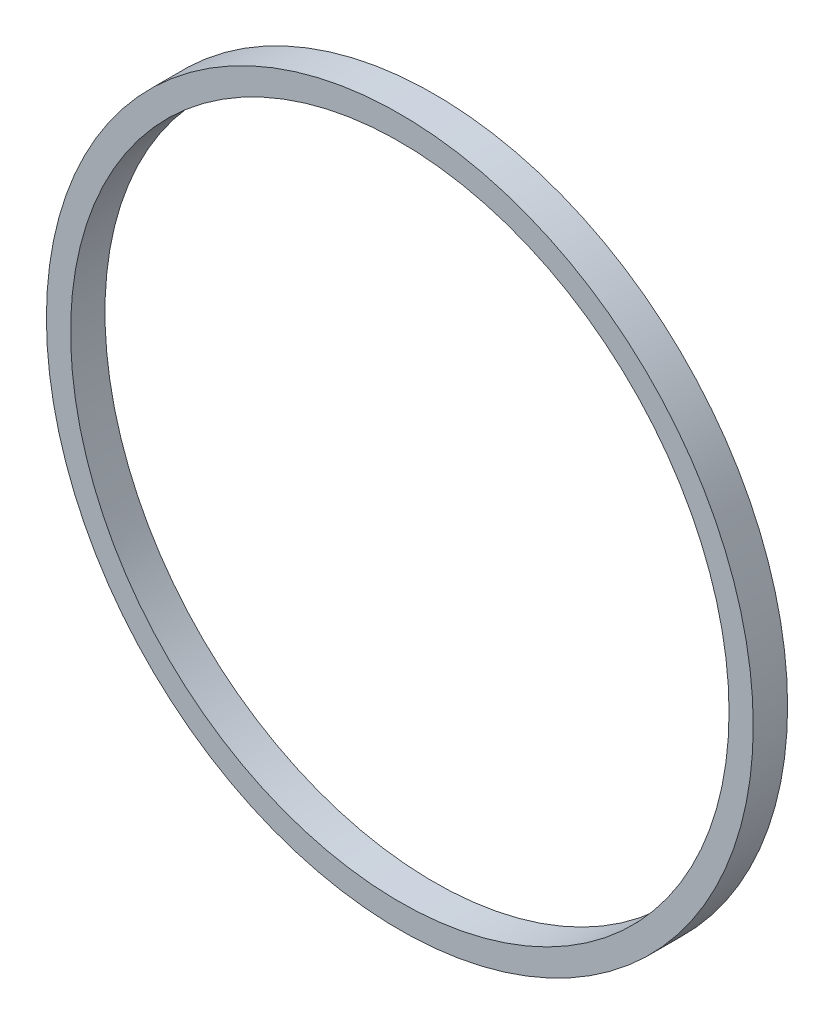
ISO-10303-21;
HEADER;
FILE_DESCRIPTION(('STEP AP214'),'2;1');
FILE_NAME('part.step','',(''),(''),'','','');
FILE_SCHEMA(('AUTOMOTIVE_DESIGN { 1 0 10303 214 1 1 1 1 }'));
ENDSEC;
DATA;
#1=APPLICATION_CONTEXT('core data for automotive mechanical design processes');
#2=APPLICATION_PROTOCOL_DEFINITION('international standard','automotive_design',2000,#1);
#3=PRODUCT_CONTEXT('',#1,'mechanical');
#4=PRODUCT('Part','Part','',(#3));
#5=PRODUCT_RELATED_PRODUCT_CATEGORY('part','',(#4));
#6=PRODUCT_DEFINITION_FORMATION('','',#4);
#7=PRODUCT_DEFINITION_CONTEXT('part definition',#1,'design');
#8=PRODUCT_DEFINITION('design','',#6,#7);
#9=PRODUCT_DEFINITION_SHAPE('','',#8);
#10=(LENGTH_UNIT() NAMED_UNIT(*) SI_UNIT(.MILLI.,.METRE.));
#11=(NAMED_UNIT(*) PLANE_ANGLE_UNIT() SI_UNIT($,.RADIAN.));
#12=(NAMED_UNIT(*) SI_UNIT($,.STERADIAN.) SOLID_ANGLE_UNIT());
#13=UNCERTAINTY_MEASURE_WITH_UNIT(LENGTH_MEASURE(1.E-05),#10,'distance_accuracy_value','');
#14=(GEOMETRIC_REPRESENTATION_CONTEXT(3) GLOBAL_UNCERTAINTY_ASSIGNED_CONTEXT((#13)) GLOBAL_UNIT_ASSIGNED_CONTEXT((#10,
#11,#12)) REPRESENTATION_CONTEXT('',''));
#15=CARTESIAN_POINT('',(0.,0.,0.));
#16=DIRECTION('',(0.,0.,1.));
#17=DIRECTION('',(1.,0.,0.));
#18=AXIS2_PLACEMENT_3D('',#15,#16,#17);
#19=CARTESIAN_POINT('',(0.,0.,1.2));
#20=DIRECTION('',(0.,0.,1.));
#21=DIRECTION('',(1.,0.,0.));
#22=AXIS2_PLACEMENT_3D('',#19,#20,#21);
#23=PLANE('',#22);
#24=CARTESIAN_POINT('',(0.,0.,1.2));
#25=DIRECTION('',(0.,0.,1.));
#26=DIRECTION('',(1.,0.,0.));
#27=AXIS2_PLACEMENT_3D('',#24,#25,#26);
#28=CIRCLE('',#27,12.345);
#29=CARTESIAN_POINT('',(12.345,0.,1.2));
#30=VERTEX_POINT('',#29);
#31=EDGE_CURVE('E10',#30,#30,#28,.T.);
#32=ORIENTED_EDGE('',*,*,#31,.T.);
#33=EDGE_LOOP('',(#32));
#34=FACE_BOUND('',#33,.T.);
#35=CARTESIAN_POINT('',(0.,0.,1.2));
#36=DIRECTION('',(0.,0.,1.));
#37=DIRECTION('',(1.,0.,0.));
#38=AXIS2_PLACEMENT_3D('',#35,#36,#37);
#39=CIRCLE('',#38,11.5);
#40=CARTESIAN_POINT('',(11.5,0.,1.2));
#41=VERTEX_POINT('',#40);
#42=EDGE_CURVE('E47',#41,#41,#39,.T.);
#43=ORIENTED_EDGE('',*,*,#42,.F.);
#44=EDGE_LOOP('',(#43));
#45=FACE_BOUND('',#44,.T.);
#46=ADVANCED_FACE('F36',(#34,#45),#23,.T.);
#47=CARTESIAN_POINT('',(0.,0.,0.));
#48=DIRECTION('',(0.,0.,1.));
#49=DIRECTION('',(1.,0.,0.));
#50=AXIS2_PLACEMENT_3D('',#47,#48,#49);
#51=PLANE('',#50);
#52=CARTESIAN_POINT('',(0.,0.,0.));
#53=DIRECTION('',(0.,0.,1.));
#54=DIRECTION('',(1.,0.,0.));
#55=AXIS2_PLACEMENT_3D('',#52,#53,#54);
#56=CIRCLE('',#55,12.345);
#57=CARTESIAN_POINT('',(12.345,0.,0.));
#58=VERTEX_POINT('',#57);
#59=EDGE_CURVE('E40',#58,#58,#56,.T.);
#60=ORIENTED_EDGE('',*,*,#59,.F.);
#61=EDGE_LOOP('',(#60));
#62=FACE_BOUND('',#61,.T.);
#63=CARTESIAN_POINT('',(0.,0.,0.));
#64=DIRECTION('',(0.,0.,1.));
#65=DIRECTION('',(1.,0.,0.));
#66=AXIS2_PLACEMENT_3D('',#63,#64,#65);
#67=CIRCLE('',#66,11.5);
#68=CARTESIAN_POINT('',(11.5,0.,0.));
#69=VERTEX_POINT('',#68);
#70=EDGE_CURVE('E49',#69,#69,#67,.T.);
#71=ORIENTED_EDGE('',*,*,#70,.T.);
#72=EDGE_LOOP('',(#71));
#73=FACE_BOUND('',#72,.T.);
#74=ADVANCED_FACE('F59',(#62,#73),#51,.F.);
#75=CARTESIAN_POINT('',(0.,0.,1.2));
#76=DIRECTION('',(0.,0.,-1.));
#77=DIRECTION('',(-1.,0.,0.));
#78=AXIS2_PLACEMENT_3D('',#75,#76,#77);
#79=CYLINDRICAL_SURFACE('',#78,12.345);
#80=ORIENTED_EDGE('',*,*,#31,.F.);
#81=EDGE_LOOP('',(#80));
#82=FACE_BOUND('',#81,.T.);
#83=ORIENTED_EDGE('',*,*,#59,.T.);
#84=EDGE_LOOP('',(#83));
#85=FACE_BOUND('',#84,.T.);
#86=ADVANCED_FACE('F38',(#82,#85),#79,.T.);
#87=CARTESIAN_POINT('',(0.,0.,1.2));
#88=DIRECTION('',(0.,0.,-1.));
#89=DIRECTION('',(-1.,0.,0.));
#90=AXIS2_PLACEMENT_3D('',#87,#88,#89);
#91=CYLINDRICAL_SURFACE('',#90,11.5);
#92=ORIENTED_EDGE('',*,*,#42,.T.);
#93=EDGE_LOOP('',(#92));
#94=FACE_BOUND('',#93,.T.);
#95=ORIENTED_EDGE('',*,*,#70,.F.);
#96=EDGE_LOOP('',(#95));
#97=FACE_BOUND('',#96,.T.);
#98=ADVANCED_FACE('F55',(#94,#97),#91,.F.);
#99=CLOSED_SHELL('',(#46,#74,#86,#98));
#100=MANIFOLD_SOLID_BREP('B2',#99);
#101=ADVANCED_BREP_SHAPE_REPRESENTATION('',(#18,#100),#14);
#102=SHAPE_DEFINITION_REPRESENTATION(#9,#101);
ENDSEC;
END-ISO-10303-21;
